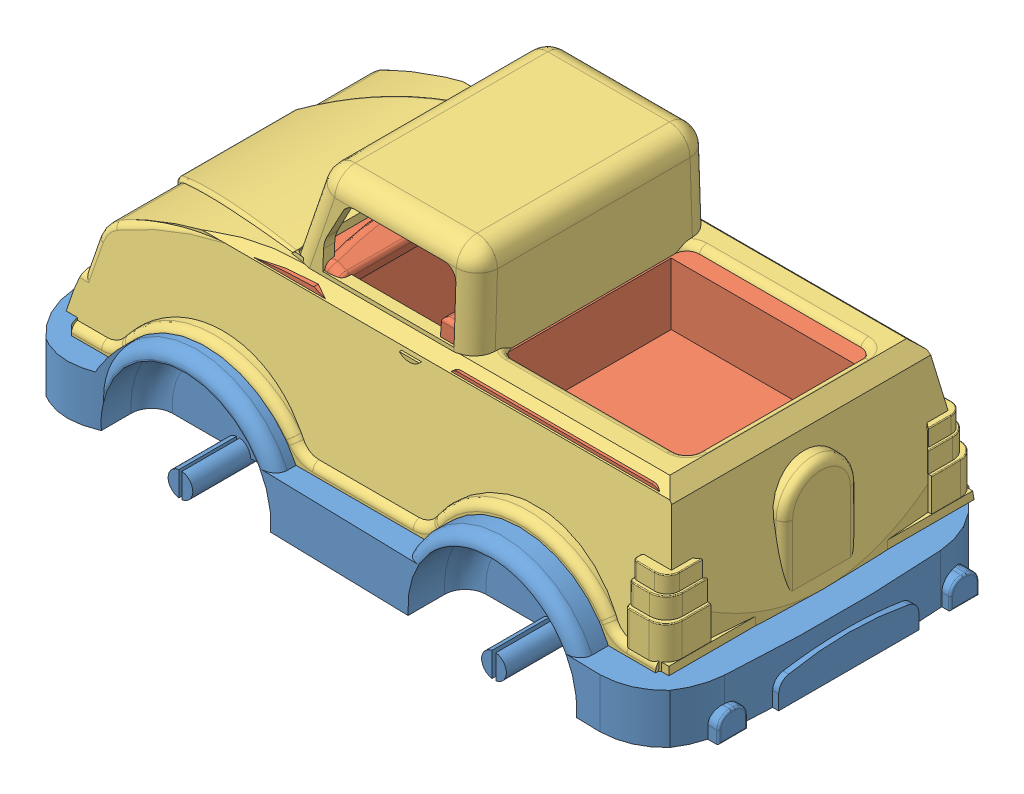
SolidWorks assembly Toy Car Exercise.SLDASM, configuration Default (file format 10000). Lengths in mm.
Overall size (163.38 71 88.13).
3 component instances, 3 part files, 6 mates.
Components (placement in the parent):
- Chasis-1: Chasis.SLDPRT [Varsayılan] at (24.1243 88.0992 135.0031) size (163.38 28.95 88.13)
- Body-1: Body.SLDPRT [Varsayılan] at (8.3176 100.0992 166.259) x (0 0 1) z (-1 0 0) size (55 44.63 135)
- Cover-1: Cover.SLDPRT [Varsayılan] at (24.4526 100.0992 132.9466) size (148.26 58.31 76.29)
Mates (geometry in assembly coordinates):
- Coincident1: coincident: plane of Chasis-1 through (93.1243 100.0992 109.0031) normal (0 0 1); plane of Body-1 through (1.7976 100.0992 109.0031) normal (0 0 -1)
- Coincident2: coincident: plane of Chasis-1 through (24.1243 100.0992 135.0031) normal (0 1 0); plane of Body-1 through (1.7976 100.0992 106.259) normal (0 -1 0)
- Coincident4: coincident: plane of Body-1 through (-10.3273 142.3889 164.0031) normal (0 0 1); plane of Cover-1 through (93.0034 115.0992 164.0031) normal (0 0 -1)
- Coincident5: coincident anti-aligned: plane of Chasis-1 through (24.1243 100.0992 135.0031) normal (0 1 0); plane of Cover-1 through (219.8406 100.0992 132.9466) normal (0 -1 0)
- Coincident9: coincident aligned: line of Chasis-1 through (83.7976 100.0992 174.866) axis (0 0 -1); line of Cover-1 through (83.7976 100.0992 169.9466) axis (0 0 -1)
- Distance1: distance = 12 mm: line of Body-1 through (-44.6824 100.0992 109.0031) axis (0 0 1); moEndPointRef_w of Chasis-1
